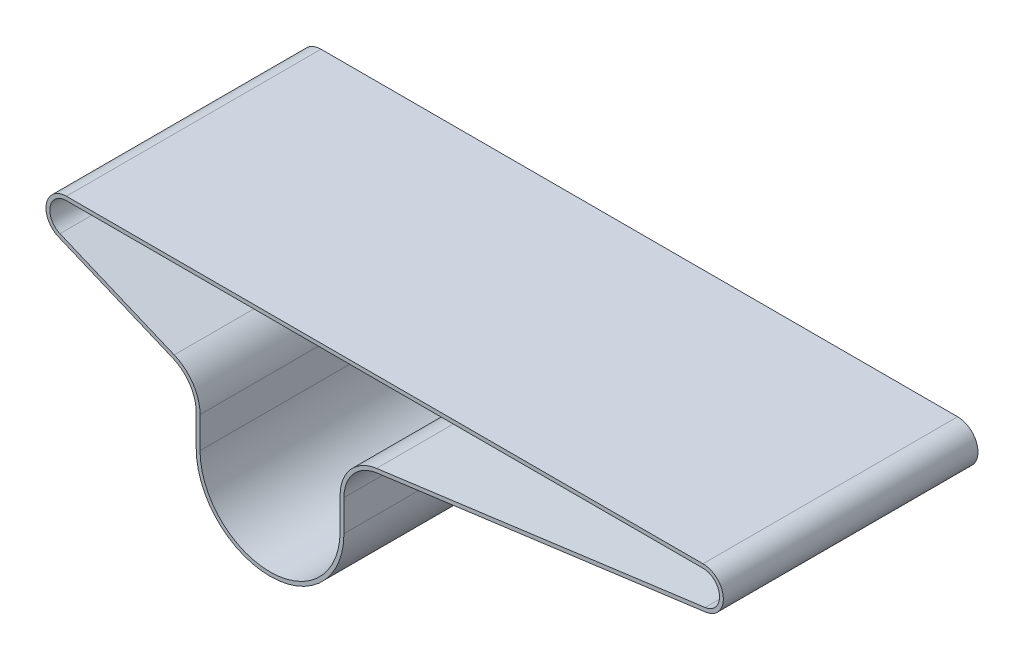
from build123d import *

# Parameters (mm, degrees)
LINEAR_AUSTRAGEN_D_NN1_DEPTH = 50


with BuildPart() as part:
    # Skizze1 → Linear-Austragen-D_nn1 (new, symmetric)
    with BuildSketch(Plane.XY):
        with BuildLine():
            Line((250, 8), (0, 8))
            ThreePointArc((0, 8), (-7.843402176, 1.57513247), (-3.088599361, -7.379739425))
            Line((-3.088599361, -7.379739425), (41.791123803, -26.162988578))
            ThreePointArc((41.791123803, -26.162988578), (48.48733072, -31.689369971), (51, -40))
            Line((51, -40), (51, -52.274500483))
            ThreePointArc((51, -52.274500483), (80, -81.274500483), (109, -52.274500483))
            Line((109, -52.274500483), (109, -40))
            ThreePointArc((109, -40), (112.71437155, -30.118978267), (122.017945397, -25.131528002))
            Line((122.017945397, -25.131528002), (251.057095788, -7.929851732))
            ThreePointArc((251.057095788, -7.929851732), (257.982443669, 0.529710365), (250, 8))
        make_face()
        with BuildLine():
            Line((250, 6.5), (0, 6.5))
            ThreePointArc((0, 6.5), (-6.372764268, 1.279795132), (-2.509486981, -5.996038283))
            Line((-2.509486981, -5.996038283), (42.370236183, -24.779287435))
            ThreePointArc((42.370236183, -24.779287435), (49.736063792, -30.858306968), (52.5, -40))
            Line((52.5, -40), (52.5, -52.274500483))
            ThreePointArc((52.5, -52.274500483), (80, -79.774500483), (107.5, -52.274500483))
            Line((107.5, -52.274500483), (107.5, -40))
            ThreePointArc((107.5, -40), (111.585808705, -29.130876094), (121.819739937, -23.644680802))
            Line((121.819739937, -23.644680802), (250.858890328, -6.443004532))
            ThreePointArc((250.858890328, -6.443004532), (256.485735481, 0.430389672), (250, 6.5))
        make_face(mode=Mode.SUBTRACT)
    extrude(amount=LINEAR_AUSTRAGEN_D_NN1_DEPTH, both=True)


solid = part.part
